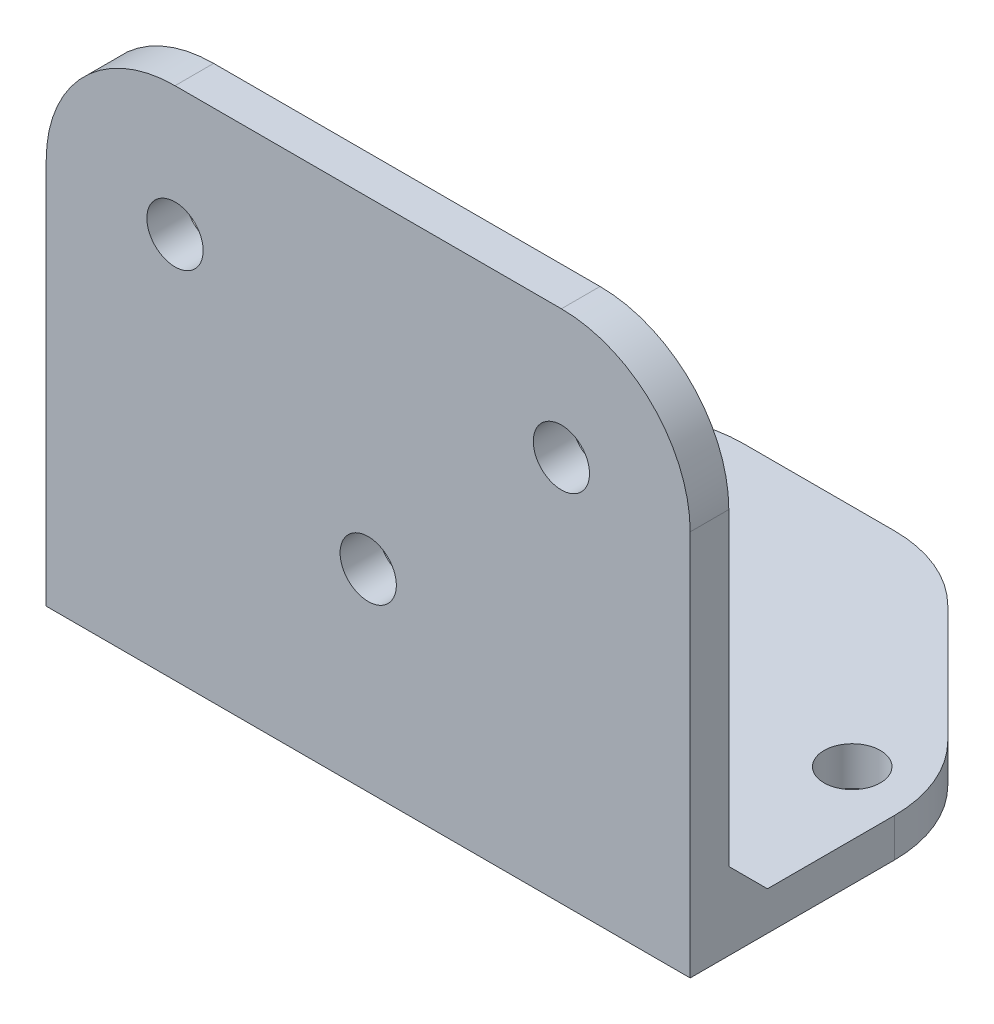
from build123d import *

# Parameters (mm, degrees)
SKETCH1_W           = 50
SKETCH1_H           = 35
SKETCH1_R           = 2.1844
BOSS_EXTRUDE1_DEPTH = 3
SKETCH3_W           = 50
SKETCH3_H           = 3
EXTRUDE_THIN1_DEPTH = 40
SKETCH4_R           = 2.1844
CUT_EXTRUDE1_DEPTH  = 58
CHAMFER1_SIZE       = 3
CHAMFER2_SIZE       = 15
FILLET1_R           = 10


with BuildPart() as part:
    # Sketch1 → Boss-Extrude1 (new body)
    with BuildSketch(Plane(origin=(0, 0, 0), x_dir=(1, 0, 0), z_dir=(0, 1, 0))):
        Rectangle(SKETCH1_W, SKETCH1_H)
        with Locations(Location((-20.0787, 0, 0), (0, 0, 270))):
            Circle(SKETCH1_R, mode=Mode.SUBTRACT)
        with Locations(Location((20.0787, 0, 0), (0, 0, 270))):
            Circle(SKETCH1_R, mode=Mode.SUBTRACT)
    extrude(amount=BOSS_EXTRUDE1_DEPTH)

    # Sketch3 → Extrude-Thin1 (add)
    with BuildSketch(Plane.XZ):
        with Locations((0, 16)):
            Rectangle(SKETCH3_W, SKETCH3_H)
    extrude(amount=-EXTRUDE_THIN1_DEPTH)

    # Sketch4 → Cut-Extrude1 (cut, through all)
    with BuildSketch(Plane(origin=(0, 0, 14.5), x_dir=(-1, 0, 0), z_dir=(0, 0, -1))):
        with Locations((15, 30)):
            Circle(SKETCH4_R)
        with Locations((-15, 30)):
            Circle(SKETCH4_R)
        with Locations((0, 15)):
            Circle(SKETCH4_R)
    extrude(amount=-CUT_EXTRUDE1_DEPTH, mode=Mode.SUBTRACT)

    # Chamfer1
    chamfer1_edges = [part.edges().sort_by_distance(p)[0] for p in [
        (0, 3, 14.5),
    ]]
    chamfer(chamfer1_edges, length=CHAMFER1_SIZE)

    # Chamfer2
    chamfer2_edges = [part.edges().sort_by_distance(p)[0] for p in [
        (-25, 1.5, -17.5),
        (25, 1.5, -17.5),
    ]]
    chamfer(chamfer2_edges, length=CHAMFER2_SIZE)

    # Fillet1
    fillet1_edges = [part.edges().sort_by_distance(p)[0] for p in [
        (-25, 40, 16),
        (25, 40, 16),
        (-25, 1.5, -2.5),
        (10, 1.5, -17.5),
        (-10, 1.5, -17.5),
        (25, 1.5, -2.5),
    ]]
    fillet(fillet1_edges, radius=FILLET1_R)


solid = part.part
